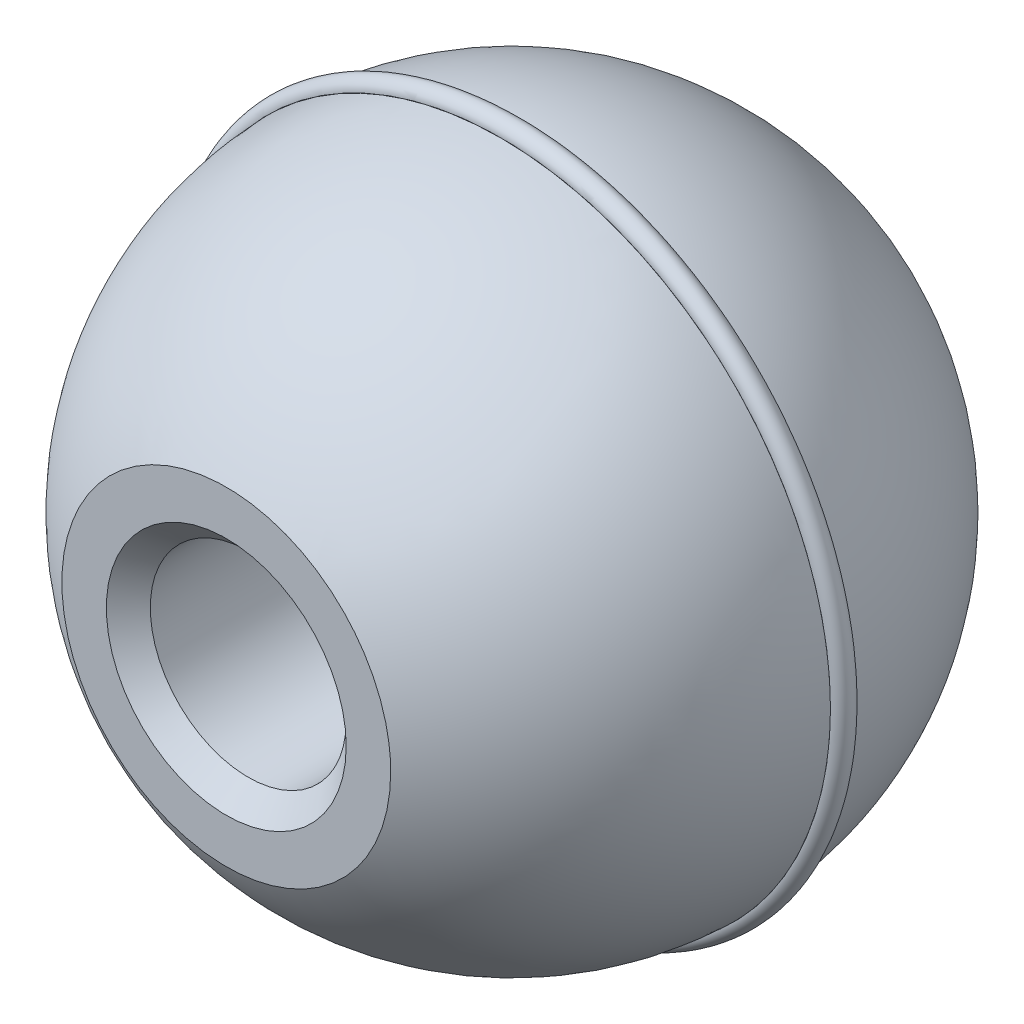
ISO-10303-21;
HEADER;
FILE_DESCRIPTION(('STEP AP214'),'2;1');
FILE_NAME('part.step','',(''),(''),'','','');
FILE_SCHEMA(('AUTOMOTIVE_DESIGN { 1 0 10303 214 1 1 1 1 }'));
ENDSEC;
DATA;
#1=APPLICATION_CONTEXT('core data for automotive mechanical design processes');
#2=APPLICATION_PROTOCOL_DEFINITION('international standard','automotive_design',2000,#1);
#3=PRODUCT_CONTEXT('',#1,'mechanical');
#4=PRODUCT('Part','Part','',(#3));
#5=PRODUCT_RELATED_PRODUCT_CATEGORY('part','',(#4));
#6=PRODUCT_DEFINITION_FORMATION('','',#4);
#7=PRODUCT_DEFINITION_CONTEXT('part definition',#1,'design');
#8=PRODUCT_DEFINITION('design','',#6,#7);
#9=PRODUCT_DEFINITION_SHAPE('','',#8);
#10=(LENGTH_UNIT() NAMED_UNIT(*) SI_UNIT(.MILLI.,.METRE.));
#11=(NAMED_UNIT(*) PLANE_ANGLE_UNIT() SI_UNIT($,.RADIAN.));
#12=(NAMED_UNIT(*) SI_UNIT($,.STERADIAN.) SOLID_ANGLE_UNIT());
#13=UNCERTAINTY_MEASURE_WITH_UNIT(LENGTH_MEASURE(1.E-05),#10,'distance_accuracy_value','');
#14=(GEOMETRIC_REPRESENTATION_CONTEXT(3) GLOBAL_UNCERTAINTY_ASSIGNED_CONTEXT((#13)) GLOBAL_UNIT_ASSIGNED_CONTEXT((#10,
#11,#12)) REPRESENTATION_CONTEXT('',''));
#15=CARTESIAN_POINT('',(0.,0.,0.));
#16=DIRECTION('',(0.,0.,1.));
#17=DIRECTION('',(1.,0.,0.));
#18=AXIS2_PLACEMENT_3D('',#15,#16,#17);
#19=CARTESIAN_POINT('',(0.,0.,13.));
#20=DIRECTION('',(0.,0.,1.));
#21=DIRECTION('',(1.,0.,0.));
#22=AXIS2_PLACEMENT_3D('',#19,#20,#21);
#23=PLANE('',#22);
#24=CARTESIAN_POINT('',(0.,0.,13.));
#25=DIRECTION('',(0.,0.,1.));
#26=DIRECTION('',(1.,0.,0.));
#27=AXIS2_PLACEMENT_3D('',#24,#25,#26);
#28=CIRCLE('',#27,5.45850000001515);
#29=CARTESIAN_POINT('',(5.45850000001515,0.,13.));
#30=VERTEX_POINT('',#29);
#31=EDGE_CURVE('E57',#30,#30,#28,.F.);
#32=ORIENTED_EDGE('',*,*,#31,.T.);
#33=EDGE_LOOP('',(#32));
#34=FACE_BOUND('',#33,.T.);
#35=CARTESIAN_POINT('',(7.48331477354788,0.,13.));
#36=CARTESIAN_POINT('',(7.48331628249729,-0.210246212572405,13.));
#37=CARTESIAN_POINT('',(7.47445072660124,-0.420467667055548,13.));
#38=CARTESIAN_POINT('',(7.43905038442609,-0.839486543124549,13.));
#39=CARTESIAN_POINT('',(7.41251094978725,-1.0482835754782,13.));
#40=CARTESIAN_POINT('',(7.34191342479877,-1.46308286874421,13.));
#41=CARTESIAN_POINT('',(7.2978397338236,-1.66908247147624,13.));
#42=CARTESIAN_POINT('',(7.19246872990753,-2.07670991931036,13.));
#43=CARTESIAN_POINT('',(7.13116512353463,-2.27833613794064,13.));
#44=CARTESIAN_POINT('',(6.99182402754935,-2.67556913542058,13.));
#45=CARTESIAN_POINT('',(6.91379774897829,-2.87117984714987,13.));
#46=CARTESIAN_POINT('',(6.74154067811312,-3.25513490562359,13.));
#47=CARTESIAN_POINT('',(6.6473096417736,-3.44347914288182,13.));
#48=CARTESIAN_POINT('',(6.4433413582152,-3.81150923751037,13.));
#49=CARTESIAN_POINT('',(6.33360827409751,-3.99119740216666,13.));
#50=CARTESIAN_POINT('',(6.09939404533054,-4.34069633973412,13.));
#51=CARTESIAN_POINT('',(5.97491255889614,-4.51050688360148,13.));
#52=CARTESIAN_POINT('',(5.71209889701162,-4.83902589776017,13.));
#53=CARTESIAN_POINT('',(5.57376782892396,-4.99773525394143,13.));
#54=CARTESIAN_POINT('',(5.2841795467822,-5.30299184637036,13.));
#55=CARTESIAN_POINT('',(5.13291787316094,-5.4495348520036,13.));
#56=CARTESIAN_POINT('',(4.81863549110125,-5.72931060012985,13.));
#57=CARTESIAN_POINT('',(4.65561854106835,-5.86254756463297,13.));
#58=CARTESIAN_POINT('',(4.31887933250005,-6.11486400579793,13.));
#59=CARTESIAN_POINT('',(4.14515314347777,-6.23393823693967,13.));
#60=CARTESIAN_POINT('',(3.7883231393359,-6.45700160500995,13.));
#61=CARTESIAN_POINT('',(3.6052213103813,-6.56099391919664,13.));
#62=CARTESIAN_POINT('',(3.23090509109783,-6.75318558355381,13.));
#63=CARTESIAN_POINT('',(3.0396905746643,-6.84138468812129,13.));
#64=CARTESIAN_POINT('',(2.6505153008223,-7.0013591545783,13.));
#65=CARTESIAN_POINT('',(2.45255468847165,-7.07313486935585,13.));
#66=CARTESIAN_POINT('',(2.05128594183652,-7.19975620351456,13.));
#67=CARTESIAN_POINT('',(1.84797768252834,-7.254601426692,13.));
#68=CARTESIAN_POINT('',(1.43750114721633,-7.34696112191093,13.));
#69=CARTESIAN_POINT('',(1.23033358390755,-7.38447876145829,13.));
#70=CARTESIAN_POINT('',(0.813502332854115,-7.44194139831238,13.));
#71=CARTESIAN_POINT('',(0.603837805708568,-7.46188030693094,13.));
#72=CARTESIAN_POINT('',(0.183649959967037,-7.484017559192,13.));
#73=CARTESIAN_POINT('',(-0.0268730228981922,-7.48622227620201,13.));
#74=CARTESIAN_POINT('',(-0.44743435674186,-7.47288974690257,13.));
#75=CARTESIAN_POINT('',(-0.657472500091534,-7.45734594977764,13.));
#76=CARTESIAN_POINT('',(-1.07545201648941,-7.40862097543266,13.));
#77=CARTESIAN_POINT('',(-1.2833937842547,-7.37544318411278,13.));
#78=CARTESIAN_POINT('',(-1.69574644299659,-7.29168753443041,13.));
#79=CARTESIAN_POINT('',(-1.9001572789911,-7.24110940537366,13.));
#80=CARTESIAN_POINT('',(-2.30398773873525,-7.1229138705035,13.));
#81=CARTESIAN_POINT('',(-2.50340745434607,-7.0552967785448,13.));
#82=CARTESIAN_POINT('',(-2.89584648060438,-6.90350177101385,13.));
#83=CARTESIAN_POINT('',(-3.08886564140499,-6.8193234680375,13.));
#84=CARTESIAN_POINT('',(-3.46709129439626,-6.63502262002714,13.));
#85=CARTESIAN_POINT('',(-3.65229922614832,-6.53490302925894,13.));
#86=CARTESIAN_POINT('',(-4.01368674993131,-6.31938259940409,13.));
#87=CARTESIAN_POINT('',(-4.18986319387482,-6.20397648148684,13.));
#88=CARTESIAN_POINT('',(-4.53180453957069,-5.95877452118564,13.));
#89=CARTESIAN_POINT('',(-4.69757314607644,-5.82898384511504,13.));
#90=CARTESIAN_POINT('',(-5.01764862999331,-5.55585106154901,13.));
#91=CARTESIAN_POINT('',(-5.17195125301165,-5.41250396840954,13.));
#92=CARTESIAN_POINT('',(-5.4679012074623,-5.11334704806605,13.));
#93=CARTESIAN_POINT('',(-5.6095509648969,-4.95753962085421,13.));
#94=CARTESIAN_POINT('',(-5.8792235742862,-4.63454355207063,13.));
#95=CARTESIAN_POINT('',(-6.0072462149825,-4.46735473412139,13.));
#96=CARTESIAN_POINT('',(-6.24874967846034,-4.12278872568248,13.));
#97=CARTESIAN_POINT('',(-6.36223078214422,-3.94541173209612,13.));
#98=CARTESIAN_POINT('',(-6.57384928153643,-3.58172800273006,13.));
#99=CARTESIAN_POINT('',(-6.67198631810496,-3.39542105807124,13.));
#100=CARTESIAN_POINT('',(-6.85220079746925,-3.01522343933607,13.));
#101=CARTESIAN_POINT('',(-6.93428124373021,-2.8213341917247,13.));
#102=CARTESIAN_POINT('',(-7.0818408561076,-2.42731528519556,13.));
#103=CARTESIAN_POINT('',(-7.14731418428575,-2.22718345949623,13.));
#104=CARTESIAN_POINT('',(-7.31799635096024,-1.61971357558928,13.));
#105=CARTESIAN_POINT('',(-7.39766124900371,-1.20489102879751,13.));
#106=CARTESIAN_POINT('',(-7.48611442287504,-0.367756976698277,13.));
#107=CARTESIAN_POINT('',(-7.49490269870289,0.0545545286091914,13.));
#108=CARTESIAN_POINT('',(-7.45494505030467,0.684281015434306,13.));
#109=CARTESIAN_POINT('',(-7.43274318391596,0.893676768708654,13.));
#110=CARTESIAN_POINT('',(-7.37078825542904,1.30983337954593,13.));
#111=CARTESIAN_POINT('',(-7.33104135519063,1.51659513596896,13.));
#112=CARTESIAN_POINT('',(-7.23426413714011,1.92606022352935,13.));
#113=CARTESIAN_POINT('',(-7.17723058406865,2.12876278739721,13.));
#114=CARTESIAN_POINT('',(-7.04629157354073,2.52864179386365,13.));
#115=CARTESIAN_POINT('',(-6.97238651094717,2.72581836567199,13.));
#116=CARTESIAN_POINT('',(-6.8082270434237,3.11324748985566,13.));
#117=CARTESIAN_POINT('',(-6.7179723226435,3.30349990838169,13.));
#118=CARTESIAN_POINT('',(-6.521757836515,3.67572249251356,13.));
#119=CARTESIAN_POINT('',(-6.41579831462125,3.85769278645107,13.));
#120=CARTESIAN_POINT('',(-6.18890459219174,4.21209436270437,13.));
#121=CARTESIAN_POINT('',(-6.06796751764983,4.38452380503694,13.));
#122=CARTESIAN_POINT('',(-5.81204221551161,4.71851792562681,13.));
#123=CARTESIAN_POINT('',(-5.67705919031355,4.88008659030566,13.));
#124=CARTESIAN_POINT('',(-5.39391359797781,5.1913364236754,13.));
#125=CARTESIAN_POINT('',(-5.24574632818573,5.34101331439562,13.));
#126=CARTESIAN_POINT('',(-4.93738081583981,5.62730112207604,13.));
#127=CARTESIAN_POINT('',(-4.77718675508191,5.76391654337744,13.));
#128=CARTESIAN_POINT('',(-4.44583034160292,6.02319318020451,13.));
#129=CARTESIAN_POINT('',(-4.27466596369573,6.14585180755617,13.));
#130=CARTESIAN_POINT('',(-3.92261662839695,6.37631086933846,13.));
#131=CARTESIAN_POINT('',(-3.74173189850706,6.48411165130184,13.));
#132=CARTESIAN_POINT('',(-3.37152070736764,6.68409389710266,13.));
#133=CARTESIAN_POINT('',(-3.18219409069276,6.77627507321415,13.));
#134=CARTESIAN_POINT('',(-2.79645128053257,6.94435900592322,13.));
#135=CARTESIAN_POINT('',(-2.60003519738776,7.02026201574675,13.));
#136=CARTESIAN_POINT('',(-2.20146870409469,7.15526479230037,13.));
#137=CARTESIAN_POINT('',(-1.99931720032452,7.21436133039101,13.));
#138=CARTESIAN_POINT('',(-1.590829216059,7.31529278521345,13.));
#139=CARTESIAN_POINT('',(-1.38449430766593,7.35713406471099,13.));
#140=CARTESIAN_POINT('',(-0.968958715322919,7.42330093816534,13.));
#141=CARTESIAN_POINT('',(-0.759757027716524,7.44762022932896,13.));
#142=CARTESIAN_POINT('',(-0.340121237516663,7.47854028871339,13.));
#143=CARTESIAN_POINT('',(-0.129687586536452,7.48514718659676,13.));
#144=CARTESIAN_POINT('',(0.291026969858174,7.4806127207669,13.));
#145=CARTESIAN_POINT('',(0.501307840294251,7.46946811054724,13.));
#146=CARTESIAN_POINT('',(0.920178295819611,7.42950424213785,13.));
#147=CARTESIAN_POINT('',(1.12876792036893,7.40068539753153,13.));
#148=CARTESIAN_POINT('',(1.54278244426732,7.32557749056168,13.));
#149=CARTESIAN_POINT('',(1.74820727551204,7.27928805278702,13.));
#150=CARTESIAN_POINT('',(2.15442395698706,7.16956897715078,13.));
#151=CARTESIAN_POINT('',(2.35521587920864,7.10613960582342,13.));
#152=CARTESIAN_POINT('',(2.75078437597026,6.96257609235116,13.));
#153=CARTESIAN_POINT('',(2.94555967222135,6.88243842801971,13.));
#154=CARTESIAN_POINT('',(3.32759464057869,6.70606903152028,13.));
#155=CARTESIAN_POINT('',(3.5148570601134,6.60984325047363,13.));
#156=CARTESIAN_POINT('',(3.88066983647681,6.40192764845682,13.));
#157=CARTESIAN_POINT('',(4.05921740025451,6.29023291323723,13.));
#158=CARTESIAN_POINT('',(4.40620663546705,6.05223831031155,13.));
#159=CARTESIAN_POINT('',(4.57465178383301,5.9259435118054,13.));
#160=CARTESIAN_POINT('',(4.90031927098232,5.65960453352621,13.));
#161=CARTESIAN_POINT('',(5.05754071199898,5.51955925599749,13.));
#162=CARTESIAN_POINT('',(5.35962491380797,5.22672662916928,13.));
#163=CARTESIAN_POINT('',(5.50448796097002,5.0739395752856,13.));
#164=CARTESIAN_POINT('',(5.78086695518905,4.7566638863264,13.));
#165=CARTESIAN_POINT('',(5.91237931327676,4.5921721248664,13.));
#166=CARTESIAN_POINT('',(6.16107551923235,4.25269578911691,13.));
#167=CARTESIAN_POINT('',(6.27825958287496,4.07771137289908,13.));
#168=CARTESIAN_POINT('',(6.49754163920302,3.71837117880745,13.));
#169=CARTESIAN_POINT('',(6.59962949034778,3.53400921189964,13.));
#170=CARTESIAN_POINT('',(6.78786393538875,3.15740467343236,13.));
#171=CARTESIAN_POINT('',(6.87401634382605,2.96516500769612,13.));
#172=CARTESIAN_POINT('',(7.02974403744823,2.5742796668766,13.));
#173=CARTESIAN_POINT('',(7.09933402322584,2.37563985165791,13.));
#174=CARTESIAN_POINT('',(7.22152362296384,1.97327222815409,13.));
#175=CARTESIAN_POINT('',(7.27412770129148,1.7695457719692,13.));
#176=CARTESIAN_POINT('',(7.37293786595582,1.30717268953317,13.));
#177=CARTESIAN_POINT('',(7.41429408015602,1.04747542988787,13.));
#178=CARTESIAN_POINT('',(7.46948159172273,0.525172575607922,13.));
#179=CARTESIAN_POINT('',(7.48331288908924,0.262566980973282,13.));
#180=CARTESIAN_POINT('',(7.48331477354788,0.,13.));
#181=B_SPLINE_CURVE_WITH_KNOTS('',3,(#35,#36,#37,#38,#39,#40,#41,#42,#43,#44,#45,#46,#47,#48,
#49,#50,#51,#52,#53,#54,#55,#56,#57,#58,#59,#60,#61,#62,#63,#64,#65,#66,#67,#68,#69,#70,#71,#72,
#73,#74,#75,#76,#77,#78,#79,#80,#81,#82,#83,#84,#85,#86,#87,#88,#89,#90,#91,#92,#93,#94,#95,#96,
#97,#98,#99,#100,#101,#102,#103,#104,#105,#106,#107,#108,#109,#110,#111,#112,#113,#114,#115,
#116,#117,#118,#119,#120,#121,#122,#123,#124,#125,#126,#127,#128,#129,#130,#131,#132,#133,#134,
#135,#136,#137,#138,#139,#140,#141,#142,#143,#144,#145,#146,#147,#148,#149,#150,#151,#152,#153,
#154,#155,#156,#157,#158,#159,#160,#161,#162,#163,#164,#165,#166,#167,#168,#169,#170,#171,#172,
#173,#174,#175,#176,#177,#178,#179,#180),.UNSPECIFIED.,.T.,.F.,(4,2,2,2,2,2,2,2,2,2,2,2,2,2,2,2,
2,2,2,2,2,2,2,2,2,2,2,2,2,2,2,2,2,2,2,2,2,2,2,2,2,2,2,2,2,2,2,2,2,2,2,2,2,2,2,2,2,2,2,2,2,2,2,2,
2,2,2,2,2,2,2,2,4),(0.,0.63050929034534,1.26118447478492,1.8924220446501,2.5238904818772,
3.15493689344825,3.78599280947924,4.41687957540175,5.04778096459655,5.67863194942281,
6.309701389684,6.94056995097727,7.57167144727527,8.20263979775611,8.83361795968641,
9.4645825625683,10.0955619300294,10.7264259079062,11.3575083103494,11.9883639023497,
12.619452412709,13.2504197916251,13.881396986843,14.5123625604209,15.1433428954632,
15.7742064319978,16.4052883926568,17.0361444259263,17.6672333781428,18.2982010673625,
18.9291785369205,19.560143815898,20.191123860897,20.8219857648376,21.4530691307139,
22.7138923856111,23.9747156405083,24.6057990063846,25.2366609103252,25.8676409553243,
26.4986062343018,27.1295837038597,27.7605513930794,28.3916403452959,29.0224963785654,
29.6535783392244,30.284441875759,30.9154222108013,31.5463877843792,32.1773649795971,
32.8083323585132,33.4394208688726,34.0702764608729,34.701358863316,35.3322228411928,
35.9632022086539,36.5941668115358,37.2251449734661,37.856113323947,38.487214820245,
39.1180833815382,39.7491528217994,40.3800038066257,41.0109051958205,41.641791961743,
42.272847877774,42.903894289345,43.5353627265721,44.1666002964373,44.7972754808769,
45.4277847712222,46.2151992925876,47.002613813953),.UNSPECIFIED.);
#182=CARTESIAN_POINT('',(7.48331477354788,0.,13.));
#183=VERTEX_POINT('',#182);
#184=EDGE_CURVE('E71',#183,#183,#181,.T.);
#185=ORIENTED_EDGE('',*,*,#184,.F.);
#186=EDGE_LOOP('',(#185));
#187=FACE_BOUND('',#186,.T.);
#188=ADVANCED_FACE('F50',(#34,#187),#23,.T.);
#189=CARTESIAN_POINT('',(0.,0.,0.));
#190=DIRECTION('',(1.,0.,0.));
#191=DIRECTION('',(0.,1.,0.));
#192=AXIS2_PLACEMENT_3D('',#189,#190,#191);
#193=SPHERICAL_SURFACE('',#192,15.);
#194=ORIENTED_EDGE('',*,*,#184,.T.);
#195=EDGE_LOOP('',(#194));
#196=FACE_BOUND('',#195,.T.);
#197=CARTESIAN_POINT('',(14.9916643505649,0.,0.5));
#198=CARTESIAN_POINT('',(14.9916644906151,-0.333641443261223,0.5));
#199=CARTESIAN_POINT('',(14.9805224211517,-0.66728470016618,0.5));
#200=CARTESIAN_POINT('',(14.9357697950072,-1.33657962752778,0.5));
#201=CARTESIAN_POINT('',(14.9019246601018,-1.67221562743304,0.5));
#202=CARTESIAN_POINT('',(14.8116749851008,-2.34051363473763,0.5));
#203=CARTESIAN_POINT('',(14.7552655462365,-2.67317498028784,0.5));
#204=CARTESIAN_POINT('',(14.6200308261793,-3.33448374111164,0.5));
#205=CARTESIAN_POINT('',(14.541168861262,-3.66312366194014,0.5));
#206=CARTESIAN_POINT('',(14.3614275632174,-4.31433958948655,0.5));
#207=CARTESIAN_POINT('',(14.2605464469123,-4.63691510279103,0.499999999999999));
#208=CARTESIAN_POINT('',(14.0095797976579,-5.35342629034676,0.499999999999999));
#209=CARTESIAN_POINT('',(13.8534956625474,-5.74527713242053,0.5));
#210=CARTESIAN_POINT('',(13.5088567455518,-6.51448105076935,0.5));
#211=CARTESIAN_POINT('',(13.3202966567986,-6.89183174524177,0.5));
#212=CARTESIAN_POINT('',(12.9120308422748,-7.62935945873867,0.5));
#213=CARTESIAN_POINT('',(12.6923212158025,-7.98953431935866,0.5));
#214=CARTESIAN_POINT('',(12.2233416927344,-8.69008623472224,0.5));
#215=CARTESIAN_POINT('',(11.974072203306,-9.03046356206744,0.500000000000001));
#216=CARTESIAN_POINT('',(11.447762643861,-9.68898227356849,0.500000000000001));
#217=CARTESIAN_POINT('',(11.1707246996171,-10.007125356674,0.5));
#218=CARTESIAN_POINT('',(10.5908292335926,-10.6189448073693,0.5));
#219=CARTESIAN_POINT('',(10.2879714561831,-10.9126209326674,0.5));
#220=CARTESIAN_POINT('',(9.65860675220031,-11.4734018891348,0.5));
#221=CARTESIAN_POINT('',(9.33210094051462,-11.7405079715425,0.5));
#222=CARTESIAN_POINT('',(8.65774952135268,-12.246265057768,0.5));
#223=CARTESIAN_POINT('',(8.30990396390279,-12.4849161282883,0.500000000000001));
#224=CARTESIAN_POINT('',(7.59533830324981,-12.9320716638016,0.500000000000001));
#225=CARTESIAN_POINT('',(7.22861783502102,-13.1405755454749,0.5));
#226=CARTESIAN_POINT('',(6.47891548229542,-13.5259489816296,0.5));
#227=CARTESIAN_POINT('',(6.0959335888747,-13.7028185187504,0.5));
#228=CARTESIAN_POINT('',(5.31642890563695,-14.0236666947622,0.5));
#229=CARTESIAN_POINT('',(4.91990603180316,-14.1676451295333,0.5));
#230=CARTESIAN_POINT('',(4.11614073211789,-14.4216860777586,0.5));
#231=CARTESIAN_POINT('',(3.7088983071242,-14.5317485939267,0.499999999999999));
#232=CARTESIAN_POINT('',(2.8865904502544,-14.7171749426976,0.499999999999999));
#233=CARTESIAN_POINT('',(2.47152504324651,-14.7925388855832,0.5));
#234=CARTESIAN_POINT('',(1.63652097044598,-14.9080327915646,0.5));
#235=CARTESIAN_POINT('',(1.21658230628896,-14.9481627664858,0.5));
#236=CARTESIAN_POINT('',(0.374817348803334,-14.9929034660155,0.5));
#237=CARTESIAN_POINT('',(-0.0470089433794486,-14.9975142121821,0.500000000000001));
#238=CARTESIAN_POINT('',(-0.889551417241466,-14.971183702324,0.499999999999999));
#239=CARTESIAN_POINT('',(-1.31026759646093,-14.9402423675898,0.499999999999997));
#240=CARTESIAN_POINT('',(-2.14759734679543,-14.8430276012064,0.499999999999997));
#241=CARTESIAN_POINT('',(-2.56421092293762,-14.7767542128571,0.499999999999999));
#242=CARTESIAN_POINT('',(-3.39036938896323,-14.6093474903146,0.500000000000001));
#243=CARTESIAN_POINT('',(-3.79991435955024,-14.5082145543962,0.5));
#244=CARTESIAN_POINT('',(-4.60903565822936,-14.2718055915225,0.5));
#245=CARTESIAN_POINT('',(-5.00861182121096,-14.1365289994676,0.499999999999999));
#246=CARTESIAN_POINT('',(-5.7949480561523,-13.8327951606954,0.500000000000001));
#247=CARTESIAN_POINT('',(-6.18170811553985,-13.66433788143,0.500000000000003));
#248=CARTESIAN_POINT('',(-6.93972204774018,-13.2954111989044,0.500000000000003));
#249=CARTESIAN_POINT('',(-7.31097346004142,-13.0949367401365,0.500000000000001));
#250=CARTESIAN_POINT('',(-8.03518100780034,-12.6634704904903,0.499999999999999));
#251=CARTESIAN_POINT('',(-8.38814136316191,-12.4324857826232,0.5));
#252=CARTESIAN_POINT('',(-9.07319121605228,-11.941719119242,0.5));
#253=CARTESIAN_POINT('',(-9.40529031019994,-11.6819505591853,0.5));
#254=CARTESIAN_POINT('',(-10.0467473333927,-11.1351095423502,0.5));
#255=CARTESIAN_POINT('',(-10.356082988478,-10.8480109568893,0.500000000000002));
#256=CARTESIAN_POINT('',(-10.9492676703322,-10.2489564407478,0.500000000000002));
#257=CARTESIAN_POINT('',(-11.2331328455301,-9.93701649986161,0.5));
#258=CARTESIAN_POINT('',(-11.7737035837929,-9.29019020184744,0.5));
#259=CARTESIAN_POINT('',(-12.0303968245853,-8.95529354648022,0.5));
#260=CARTESIAN_POINT('',(-12.5146408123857,-8.26507600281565,0.5));
#261=CARTESIAN_POINT('',(-12.7421927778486,-7.90975596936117,0.5));
#262=CARTESIAN_POINT('',(-13.1664522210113,-7.18137103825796,0.5));
#263=CARTESIAN_POINT('',(-13.3631736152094,-6.80831424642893,0.499999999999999));
#264=CARTESIAN_POINT('',(-13.7248253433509,-6.04626910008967,0.499999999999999));
#265=CARTESIAN_POINT('',(-13.8896974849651,-5.65725312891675,0.5));
#266=CARTESIAN_POINT('',(-14.1859131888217,-4.86700862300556,0.5));
#267=CARTESIAN_POINT('',(-14.3172833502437,-4.46579006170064,0.5));
#268=CARTESIAN_POINT('',(-14.5455299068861,-3.65443230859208,0.5));
#269=CARTESIAN_POINT('',(-14.64246628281,-3.24430996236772,0.5));
#270=CARTESIAN_POINT('',(-14.8014541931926,-2.4174518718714,0.5));
#271=CARTESIAN_POINT('',(-14.8635179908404,-2.000718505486,0.5));
#272=CARTESIAN_POINT('',(-14.9297868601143,-1.37635647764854,0.5));
#273=CARTESIAN_POINT('',(-14.94736721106,-1.17006798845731,0.5));
#274=CARTESIAN_POINT('',(-14.973973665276,-0.756940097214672,0.5));
#275=CARTESIAN_POINT('',(-14.9829997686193,-0.55010069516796,0.499999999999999));
#276=CARTESIAN_POINT('',(-14.9973670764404,0.0776039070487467,0.499999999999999));
#277=CARTESIAN_POINT('',(-14.9892715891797,0.49885569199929,0.5));
#278=CARTESIAN_POINT('',(-14.9376605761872,1.33927684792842,0.5));
#279=CARTESIAN_POINT('',(-14.8941325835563,1.75844543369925,0.5));
#280=CARTESIAN_POINT('',(-14.7718468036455,2.5923783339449,0.5));
#281=CARTESIAN_POINT('',(-14.6930273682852,3.00713363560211,0.5));
#282=CARTESIAN_POINT('',(-14.5006256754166,3.82884633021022,0.5));
#283=CARTESIAN_POINT('',(-14.387015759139,4.23579724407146,0.5));
#284=CARTESIAN_POINT('',(-14.1261014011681,5.03793719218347,0.5));
#285=CARTESIAN_POINT('',(-13.9788582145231,5.43314615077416,0.5));
#286=CARTESIAN_POINT('',(-13.6515356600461,6.20993481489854,0.5));
#287=CARTESIAN_POINT('',(-13.4714414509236,6.59150826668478,0.5));
#288=CARTESIAN_POINT('',(-13.0797340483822,7.33813923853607,0.5));
#289=CARTESIAN_POINT('',(-12.868119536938,7.70319606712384,0.5));
#290=CARTESIAN_POINT('',(-12.4149847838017,8.41401944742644,0.5));
#291=CARTESIAN_POINT('',(-12.1734780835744,8.75979463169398,0.5));
#292=CARTESIAN_POINT('',(-11.662036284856,9.42998972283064,0.5));
#293=CARTESIAN_POINT('',(-11.3920831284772,9.75439584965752,0.5));
#294=CARTESIAN_POINT('',(-10.8260702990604,10.3790007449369,0.5));
#295=CARTESIAN_POINT('',(-10.5300360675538,10.6792225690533,0.5));
#296=CARTESIAN_POINT('',(-9.91359756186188,11.253808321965,0.5));
#297=CARTESIAN_POINT('',(-9.59318203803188,11.5281601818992,0.5));
#298=CARTESIAN_POINT('',(-8.93030247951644,12.0489584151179,0.5));
#299=CARTESIAN_POINT('',(-8.58783335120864,12.2953983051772,0.5));
#300=CARTESIAN_POINT('',(-7.88340443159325,12.7585100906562,0.5));
#301=CARTESIAN_POINT('',(-7.52144772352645,12.975186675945,0.5));
#302=CARTESIAN_POINT('',(-6.78056786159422,13.377277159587,0.5));
#303=CARTESIAN_POINT('',(-6.40164472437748,13.5626910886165,0.5));
#304=CARTESIAN_POINT('',(-5.62953247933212,13.9009353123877,0.5));
#305=CARTESIAN_POINT('',(-5.23634362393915,14.0537661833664,0.5));
#306=CARTESIAN_POINT('',(-4.43848431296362,14.3257634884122,0.5));
#307=CARTESIAN_POINT('',(-4.03381372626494,14.444929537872,0.5));
#308=CARTESIAN_POINT('',(-3.21587146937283,14.648747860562,0.5));
#309=CARTESIAN_POINT('',(-2.80259978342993,14.7334000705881,0.5));
#310=CARTESIAN_POINT('',(-1.97039508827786,14.867588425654,0.5));
#311=CARTESIAN_POINT('',(-1.55146209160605,14.9171246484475,0.5));
#312=CARTESIAN_POINT('',(-0.71091201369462,14.9807291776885,0.5));
#313=CARTESIAN_POINT('',(-0.289294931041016,14.9947974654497,0.5));
#314=CARTESIAN_POINT('',(0.553625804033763,14.9873660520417,0.5));
#315=CARTESIAN_POINT('',(0.974929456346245,14.9658663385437,0.5));
#316=CARTESIAN_POINT('',(1.81422590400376,14.8874519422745,0.5));
#317=CARTESIAN_POINT('',(2.23221871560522,14.8305374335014,0.5));
#318=CARTESIAN_POINT('',(3.06192392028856,14.6816982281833,0.5));
#319=CARTESIAN_POINT('',(3.47363631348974,14.5897735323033,0.5));
#320=CARTESIAN_POINT('',(4.28785774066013,14.3715663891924,0.5));
#321=CARTESIAN_POINT('',(4.69036668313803,14.2452836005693,0.5));
#322=CARTESIAN_POINT('',(5.48331532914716,13.9592584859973,0.5));
#323=CARTESIAN_POINT('',(5.87375503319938,13.7995161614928,0.5));
#324=CARTESIAN_POINT('',(6.63980100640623,13.4477023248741,0.5));
#325=CARTESIAN_POINT('',(7.01540682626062,13.2556298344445,0.5));
#326=CARTESIAN_POINT('',(7.7491021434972,12.8405245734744,0.5));
#327=CARTESIAN_POINT('',(8.10719163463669,12.6174917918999,0.5));
#328=CARTESIAN_POINT('',(8.80328376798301,12.1420684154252,0.5));
#329=CARTESIAN_POINT('',(9.14128781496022,11.8896798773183,0.5));
#330=CARTESIAN_POINT('',(9.79483285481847,11.3573271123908,0.5));
#331=CARTESIAN_POINT('',(10.1103738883,11.0773629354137,0.5));
#332=CARTESIAN_POINT('',(10.7167033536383,10.4918942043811,0.5));
#333=CARTESIAN_POINT('',(11.0074956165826,10.1863936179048,0.5));
#334=CARTESIAN_POINT('',(11.5623176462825,9.551983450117,0.5));
#335=CARTESIAN_POINT('',(11.8263472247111,9.22307370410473,0.5));
#336=CARTESIAN_POINT('',(12.3258617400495,8.54405330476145,0.5));
#337=CARTESIAN_POINT('',(12.5613356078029,8.19393450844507,0.5));
#338=CARTESIAN_POINT('',(13.0019389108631,7.47511127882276,0.5));
#339=CARTESIAN_POINT('',(13.2070692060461,7.10640737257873,0.5));
#340=CARTESIAN_POINT('',(13.5856599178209,6.35277782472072,0.5));
#341=CARTESIAN_POINT('',(13.7590992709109,5.96784160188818,0.5));
#342=CARTESIAN_POINT('',(14.0729048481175,5.18471625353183,0.5));
#343=CARTESIAN_POINT('',(14.213271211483,4.78652718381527,0.5));
#344=CARTESIAN_POINT('',(14.4597547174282,3.98031856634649,0.5));
#345=CARTESIAN_POINT('',(14.5659206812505,3.5723139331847,0.5));
#346=CARTESIAN_POINT('',(14.7434851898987,2.74897767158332,0.5));
#347=CARTESIAN_POINT('',(14.8148997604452,2.33364951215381,0.5));
#348=CARTESIAN_POINT('',(14.9096624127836,1.59833383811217,0.5));
#349=CARTESIAN_POINT('',(14.9404184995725,1.27927932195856,0.5));
#350=CARTESIAN_POINT('',(14.9814095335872,0.640149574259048,0.5));
#351=CARTESIAN_POINT('',(14.9916642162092,0.320075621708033,0.5));
#352=CARTESIAN_POINT('',(14.9916643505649,0.,0.5));
#353=B_SPLINE_CURVE_WITH_KNOTS('',3,(#197,#198,#199,#200,#201,#202,#203,#204,#205,#206,#207,
#208,#209,#210,#211,#212,#213,#214,#215,#216,#217,#218,#219,#220,#221,#222,#223,#224,#225,#226,
#227,#228,#229,#230,#231,#232,#233,#234,#235,#236,#237,#238,#239,#240,#241,#242,#243,#244,#245,
#246,#247,#248,#249,#250,#251,#252,#253,#254,#255,#256,#257,#258,#259,#260,#261,#262,#263,#264,
#265,#266,#267,#268,#269,#270,#271,#272,#273,#274,#275,#276,#277,#278,#279,#280,#281,#282,#283,
#284,#285,#286,#287,#288,#289,#290,#291,#292,#293,#294,#295,#296,#297,#298,#299,#300,#301,#302,
#303,#304,#305,#306,#307,#308,#309,#310,#311,#312,#313,#314,#315,#316,#317,#318,#319,#320,#321,
#322,#323,#324,#325,#326,#327,#328,#329,#330,#331,#332,#333,#334,#335,#336,#337,#338,#339,#340,
#341,#342,#343,#344,#345,#346,#347,#348,#349,#350,#351,#352),.UNSPECIFIED.,.T.,.F.,(4,2,2,2,2,2,
2,2,2,2,2,2,2,2,2,2,2,2,2,2,2,2,2,2,2,2,2,2,2,2,2,2,2,2,2,2,2,2,2,2,2,2,2,2,2,2,2,2,2,2,2,2,2,2,
2,2,2,2,2,2,2,2,2,2,2,2,2,2,2,2,2,2,2,2,2,2,2,4),(0.,1.00074284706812,2.01198843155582,
3.02345367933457,4.03658107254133,5.04979054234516,6.31361675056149,7.57764967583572,
8.84184102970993,10.1060149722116,11.3700922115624,12.6341819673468,13.8982121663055,
15.1622394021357,16.4262910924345,17.6903434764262,18.9544037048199,20.218463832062,
21.4825199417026,22.7465756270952,24.0106305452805,25.2746882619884,26.5387444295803,
27.8027861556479,29.0668488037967,30.3309126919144,31.5951763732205,32.8591470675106,
34.1225319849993,35.3871371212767,36.6509347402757,37.9153030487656,39.1796184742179,
40.4433615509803,41.7093922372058,42.9744145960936,44.237222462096,45.499585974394,
46.1205422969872,46.7414986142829,48.0038620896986,49.2666699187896,50.5316923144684,
51.7977230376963,53.0614661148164,54.3257815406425,55.5901498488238,56.8539474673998,
58.1185522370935,59.3819367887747,60.6459078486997,61.910171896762,63.1742365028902,
64.4382998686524,65.7023408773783,66.966396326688,68.2304540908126,69.4945090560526,
70.7585646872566,72.0226207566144,73.286670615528,74.5507204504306,75.8147828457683,
77.0788451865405,78.3429457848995,79.6070468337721,80.8710593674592,82.1350696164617,
83.3988838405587,84.6627069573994,85.9270184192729,87.191294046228,88.4564069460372,
89.7215145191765,90.9848080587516,92.2475184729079,93.2084967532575,94.1685495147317),.UNSPECIFIED.);
#354=CARTESIAN_POINT('',(14.9916643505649,0.,0.5));
#355=VERTEX_POINT('',#354);
#356=EDGE_CURVE('E80',#355,#355,#353,.T.);
#357=ORIENTED_EDGE('',*,*,#356,.F.);
#358=EDGE_LOOP('',(#357));
#359=FACE_BOUND('',#358,.T.);
#360=ADVANCED_FACE('F88',(#196,#359),#193,.T.);
#361=CARTESIAN_POINT('',(0.,0.,0.5));
#362=DIRECTION('',(0.,0.,1.));
#363=DIRECTION('',(1.,0.,0.));
#364=AXIS2_PLACEMENT_3D('',#361,#362,#363);
#365=PLANE('',#364);
#366=ORIENTED_EDGE('',*,*,#356,.T.);
#367=EDGE_LOOP('',(#366));
#368=FACE_BOUND('',#367,.T.);
#369=CARTESIAN_POINT('',(0.,0.,0.5));
#370=DIRECTION('',(0.,0.,-1.));
#371=DIRECTION('',(1.,0.,0.));
#372=AXIS2_PLACEMENT_3D('',#369,#370,#371);
#373=CIRCLE('',#372,15.);
#374=CARTESIAN_POINT('',(15.,0.,0.5));
#375=VERTEX_POINT('',#374);
#376=EDGE_CURVE('E181',#375,#375,#373,.T.);
#377=ORIENTED_EDGE('',*,*,#376,.F.);
#378=EDGE_LOOP('',(#377));
#379=FACE_BOUND('',#378,.T.);
#380=ADVANCED_FACE('F144',(#368,#379),#365,.T.);
#381=CARTESIAN_POINT('',(0.,0.,0.));
#382=DIRECTION('',(0.,0.,1.));
#383=DIRECTION('',(1.,0.,0.));
#384=AXIS2_PLACEMENT_3D('',#381,#382,#383);
#385=TOROIDAL_SURFACE('',#384,15.,0.5);
#386=CARTESIAN_POINT('',(0.,0.,-0.5));
#387=DIRECTION('',(0.,0.,1.));
#388=DIRECTION('',(1.,0.,0.));
#389=AXIS2_PLACEMENT_3D('',#386,#387,#388);
#390=CIRCLE('',#389,15.);
#391=CARTESIAN_POINT('',(15.,0.,-0.5));
#392=VERTEX_POINT('',#391);
#393=EDGE_CURVE('E130',#392,#392,#390,.T.);
#394=ORIENTED_EDGE('',*,*,#393,.T.);
#395=EDGE_LOOP('',(#394));
#396=FACE_BOUND('',#395,.T.);
#397=ORIENTED_EDGE('',*,*,#376,.T.);
#398=EDGE_LOOP('',(#397));
#399=FACE_BOUND('',#398,.T.);
#400=ADVANCED_FACE('F116',(#396,#399),#385,.T.);
#401=CARTESIAN_POINT('',(0.,0.,-0.5));
#402=DIRECTION('',(0.,0.,1.));
#403=DIRECTION('',(1.,0.,0.));
#404=AXIS2_PLACEMENT_3D('',#401,#402,#403);
#405=PLANE('',#404);
#406=CARTESIAN_POINT('',(14.9916643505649,0.,-0.5));
#407=CARTESIAN_POINT('',(14.9916644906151,-0.333641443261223,-0.5));
#408=CARTESIAN_POINT('',(14.9805224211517,-0.66728470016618,-0.5));
#409=CARTESIAN_POINT('',(14.9357697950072,-1.33657962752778,-0.5));
#410=CARTESIAN_POINT('',(14.9019246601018,-1.67221562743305,-0.5));
#411=CARTESIAN_POINT('',(14.8116749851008,-2.34051363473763,-0.5));
#412=CARTESIAN_POINT('',(14.7552655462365,-2.67317498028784,-0.5));
#413=CARTESIAN_POINT('',(14.6200308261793,-3.33448374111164,-0.5));
#414=CARTESIAN_POINT('',(14.541168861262,-3.66312366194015,-0.5));
#415=CARTESIAN_POINT('',(14.3614275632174,-4.31433958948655,-0.5));
#416=CARTESIAN_POINT('',(14.2605464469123,-4.63691510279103,-0.5));
#417=CARTESIAN_POINT('',(14.0095797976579,-5.35342629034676,-0.5));
#418=CARTESIAN_POINT('',(13.8534956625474,-5.74527713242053,-0.5));
#419=CARTESIAN_POINT('',(13.5088567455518,-6.51448105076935,-0.5));
#420=CARTESIAN_POINT('',(13.3202966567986,-6.89183174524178,-0.5));
#421=CARTESIAN_POINT('',(12.9120308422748,-7.62935945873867,-0.5));
#422=CARTESIAN_POINT('',(12.6923212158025,-7.98953431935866,-0.5));
#423=CARTESIAN_POINT('',(12.2233416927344,-8.69008623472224,-0.5));
#424=CARTESIAN_POINT('',(11.974072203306,-9.03046356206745,-0.499999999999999));
#425=CARTESIAN_POINT('',(11.447762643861,-9.6889822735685,-0.499999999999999));
#426=CARTESIAN_POINT('',(11.1707246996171,-10.007125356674,-0.5));
#427=CARTESIAN_POINT('',(10.5908292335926,-10.6189448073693,-0.5));
#428=CARTESIAN_POINT('',(10.2879714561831,-10.9126209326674,-0.5));
#429=CARTESIAN_POINT('',(9.65860675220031,-11.4734018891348,-0.5));
#430=CARTESIAN_POINT('',(9.33210094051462,-11.7405079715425,-0.5));
#431=CARTESIAN_POINT('',(8.65774952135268,-12.246265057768,-0.5));
#432=CARTESIAN_POINT('',(8.30990396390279,-12.4849161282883,-0.499999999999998));
#433=CARTESIAN_POINT('',(7.59533830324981,-12.9320716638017,-0.499999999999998));
#434=CARTESIAN_POINT('',(7.22861783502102,-13.1405755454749,-0.499999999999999));
#435=CARTESIAN_POINT('',(6.47891548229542,-13.5259489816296,-0.500000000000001));
#436=CARTESIAN_POINT('',(6.0959335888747,-13.7028185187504,-0.5));
#437=CARTESIAN_POINT('',(5.31642890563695,-14.0236666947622,-0.5));
#438=CARTESIAN_POINT('',(4.91990603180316,-14.1676451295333,-0.5));
#439=CARTESIAN_POINT('',(4.11614073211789,-14.4216860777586,-0.5));
#440=CARTESIAN_POINT('',(3.7088983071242,-14.5317485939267,-0.500000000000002));
#441=CARTESIAN_POINT('',(2.8865904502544,-14.7171749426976,-0.500000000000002));
#442=CARTESIAN_POINT('',(2.47152504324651,-14.7925388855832,-0.5));
#443=CARTESIAN_POINT('',(1.63652097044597,-14.9080327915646,-0.5));
#444=CARTESIAN_POINT('',(1.21658230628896,-14.9481627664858,-0.5));
#445=CARTESIAN_POINT('',(0.374817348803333,-14.9929034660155,-0.5));
#446=CARTESIAN_POINT('',(-0.0470089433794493,-14.9975142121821,-0.5));
#447=CARTESIAN_POINT('',(-0.889551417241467,-14.971183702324,-0.5));
#448=CARTESIAN_POINT('',(-1.31026759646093,-14.9402423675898,-0.5));
#449=CARTESIAN_POINT('',(-2.14759734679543,-14.8430276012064,-0.5));
#450=CARTESIAN_POINT('',(-2.56421092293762,-14.7767542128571,-0.5));
#451=CARTESIAN_POINT('',(-3.39036938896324,-14.6093474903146,-0.5));
#452=CARTESIAN_POINT('',(-3.79991435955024,-14.5082145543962,-0.5));
#453=CARTESIAN_POINT('',(-4.60903565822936,-14.2718055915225,-0.5));
#454=CARTESIAN_POINT('',(-5.00861182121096,-14.1365289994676,-0.5));
#455=CARTESIAN_POINT('',(-5.7949480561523,-13.8327951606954,-0.5));
#456=CARTESIAN_POINT('',(-6.18170811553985,-13.66433788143,-0.499999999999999));
#457=CARTESIAN_POINT('',(-6.93972204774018,-13.2954111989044,-0.499999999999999));
#458=CARTESIAN_POINT('',(-7.31097346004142,-13.0949367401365,-0.5));
#459=CARTESIAN_POINT('',(-8.03518100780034,-12.6634704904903,-0.5));
#460=CARTESIAN_POINT('',(-8.38814136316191,-12.4324857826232,-0.5));
#461=CARTESIAN_POINT('',(-9.07319121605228,-11.941719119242,-0.5));
#462=CARTESIAN_POINT('',(-9.40529031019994,-11.6819505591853,-0.5));
#463=CARTESIAN_POINT('',(-10.0467473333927,-11.1351095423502,-0.5));
#464=CARTESIAN_POINT('',(-10.356082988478,-10.8480109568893,-0.499999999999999));
#465=CARTESIAN_POINT('',(-10.9492676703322,-10.2489564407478,-0.499999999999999));
#466=CARTESIAN_POINT('',(-11.2331328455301,-9.93701649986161,-0.5));
#467=CARTESIAN_POINT('',(-11.7737035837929,-9.29019020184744,-0.5));
#468=CARTESIAN_POINT('',(-12.0303968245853,-8.95529354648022,-0.5));
#469=CARTESIAN_POINT('',(-12.5146408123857,-8.26507600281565,-0.5));
#470=CARTESIAN_POINT('',(-12.7421927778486,-7.90975596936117,-0.5));
#471=CARTESIAN_POINT('',(-13.1664522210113,-7.18137103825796,-0.5));
#472=CARTESIAN_POINT('',(-13.3631736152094,-6.80831424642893,-0.5));
#473=CARTESIAN_POINT('',(-13.7248253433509,-6.04626910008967,-0.5));
#474=CARTESIAN_POINT('',(-13.8896974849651,-5.65725312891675,-0.5));
#475=CARTESIAN_POINT('',(-14.1859131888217,-4.86700862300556,-0.5));
#476=CARTESIAN_POINT('',(-14.3172833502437,-4.46579006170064,-0.5));
#477=CARTESIAN_POINT('',(-14.5455299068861,-3.65443230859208,-0.5));
#478=CARTESIAN_POINT('',(-14.64246628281,-3.24430996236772,-0.5));
#479=CARTESIAN_POINT('',(-14.8014541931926,-2.4174518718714,-0.5));
#480=CARTESIAN_POINT('',(-14.8635179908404,-2.000718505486,-0.5));
#481=CARTESIAN_POINT('',(-14.9297868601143,-1.37635647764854,-0.5));
#482=CARTESIAN_POINT('',(-14.94736721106,-1.17006798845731,-0.5));
#483=CARTESIAN_POINT('',(-14.973973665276,-0.756940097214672,-0.5));
#484=CARTESIAN_POINT('',(-14.9829997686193,-0.55010069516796,-0.499999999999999));
#485=CARTESIAN_POINT('',(-14.9973670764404,0.0776039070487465,-0.499999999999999));
#486=CARTESIAN_POINT('',(-14.9892715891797,0.49885569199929,-0.5));
#487=CARTESIAN_POINT('',(-14.9376605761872,1.33927684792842,-0.5));
#488=CARTESIAN_POINT('',(-14.8941325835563,1.75844543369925,-0.5));
#489=CARTESIAN_POINT('',(-14.7718468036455,2.5923783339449,-0.5));
#490=CARTESIAN_POINT('',(-14.6930273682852,3.00713363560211,-0.5));
#491=CARTESIAN_POINT('',(-14.5006256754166,3.82884633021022,-0.5));
#492=CARTESIAN_POINT('',(-14.387015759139,4.23579724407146,-0.5));
#493=CARTESIAN_POINT('',(-14.1261014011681,5.03793719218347,-0.5));
#494=CARTESIAN_POINT('',(-13.9788582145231,5.43314615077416,-0.5));
#495=CARTESIAN_POINT('',(-13.6515356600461,6.20993481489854,-0.5));
#496=CARTESIAN_POINT('',(-13.4714414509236,6.59150826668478,-0.5));
#497=CARTESIAN_POINT('',(-13.0797340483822,7.33813923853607,-0.5));
#498=CARTESIAN_POINT('',(-12.868119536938,7.70319606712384,-0.499999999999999));
#499=CARTESIAN_POINT('',(-12.4149847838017,8.41401944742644,-0.500000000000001));
#500=CARTESIAN_POINT('',(-12.1734780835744,8.75979463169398,-0.500000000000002));
#501=CARTESIAN_POINT('',(-11.662036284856,9.42998972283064,-0.500000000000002));
#502=CARTESIAN_POINT('',(-11.3920831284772,9.75439584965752,-0.500000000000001));
#503=CARTESIAN_POINT('',(-10.8260702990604,10.3790007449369,-0.499999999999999));
#504=CARTESIAN_POINT('',(-10.5300360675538,10.6792225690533,-0.5));
#505=CARTESIAN_POINT('',(-9.91359756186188,11.253808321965,-0.5));
#506=CARTESIAN_POINT('',(-9.59318203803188,11.5281601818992,-0.5));
#507=CARTESIAN_POINT('',(-8.93030247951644,12.0489584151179,-0.5));
#508=CARTESIAN_POINT('',(-8.58783335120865,12.2953983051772,-0.5));
#509=CARTESIAN_POINT('',(-7.88340443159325,12.7585100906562,-0.5));
#510=CARTESIAN_POINT('',(-7.52144772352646,12.975186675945,-0.5));
#511=CARTESIAN_POINT('',(-6.78056786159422,13.377277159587,-0.5));
#512=CARTESIAN_POINT('',(-6.40164472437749,13.5626910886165,-0.5));
#513=CARTESIAN_POINT('',(-5.62953247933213,13.9009353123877,-0.5));
#514=CARTESIAN_POINT('',(-5.23634362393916,14.0537661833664,-0.5));
#515=CARTESIAN_POINT('',(-4.43848431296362,14.3257634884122,-0.5));
#516=CARTESIAN_POINT('',(-4.03381372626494,14.444929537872,-0.5));
#517=CARTESIAN_POINT('',(-3.21587146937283,14.648747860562,-0.5));
#518=CARTESIAN_POINT('',(-2.80259978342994,14.7334000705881,-0.5));
#519=CARTESIAN_POINT('',(-1.97039508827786,14.867588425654,-0.5));
#520=CARTESIAN_POINT('',(-1.55146209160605,14.9171246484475,-0.5));
#521=CARTESIAN_POINT('',(-0.710912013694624,14.9807291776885,-0.5));
#522=CARTESIAN_POINT('',(-0.289294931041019,14.9947974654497,-0.5));
#523=CARTESIAN_POINT('',(0.55362580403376,14.9873660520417,-0.5));
#524=CARTESIAN_POINT('',(0.974929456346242,14.9658663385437,-0.499999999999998));
#525=CARTESIAN_POINT('',(1.81422590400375,14.8874519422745,-0.499999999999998));
#526=CARTESIAN_POINT('',(2.23221871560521,14.8305374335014,-0.499999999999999));
#527=CARTESIAN_POINT('',(3.06192392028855,14.6816982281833,-0.500000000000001));
#528=CARTESIAN_POINT('',(3.47363631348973,14.5897735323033,-0.5));
#529=CARTESIAN_POINT('',(4.28785774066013,14.3715663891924,-0.5));
#530=CARTESIAN_POINT('',(4.69036668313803,14.2452836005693,-0.499999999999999));
#531=CARTESIAN_POINT('',(5.48331532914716,13.9592584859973,-0.500000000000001));
#532=CARTESIAN_POINT('',(5.87375503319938,13.7995161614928,-0.500000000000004));
#533=CARTESIAN_POINT('',(6.63980100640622,13.4477023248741,-0.500000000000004));
#534=CARTESIAN_POINT('',(7.01540682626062,13.2556298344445,-0.500000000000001));
#535=CARTESIAN_POINT('',(7.7491021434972,12.8405245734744,-0.499999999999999));
#536=CARTESIAN_POINT('',(8.10719163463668,12.6174917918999,-0.5));
#537=CARTESIAN_POINT('',(8.80328376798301,12.1420684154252,-0.5));
#538=CARTESIAN_POINT('',(9.14128781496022,11.8896798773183,-0.500000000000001));
#539=CARTESIAN_POINT('',(9.79483285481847,11.3573271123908,-0.499999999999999));
#540=CARTESIAN_POINT('',(10.1103738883,11.0773629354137,-0.499999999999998));
#541=CARTESIAN_POINT('',(10.7167033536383,10.4918942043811,-0.499999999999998));
#542=CARTESIAN_POINT('',(11.0074956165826,10.1863936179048,-0.5));
#543=CARTESIAN_POINT('',(11.5623176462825,9.551983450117,-0.5));
#544=CARTESIAN_POINT('',(11.8263472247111,9.22307370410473,-0.5));
#545=CARTESIAN_POINT('',(12.3258617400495,8.54405330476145,-0.5));
#546=CARTESIAN_POINT('',(12.5613356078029,8.19393450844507,-0.500000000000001));
#547=CARTESIAN_POINT('',(13.0019389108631,7.47511127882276,-0.499999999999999));
#548=CARTESIAN_POINT('',(13.2070692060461,7.10640737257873,-0.499999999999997));
#549=CARTESIAN_POINT('',(13.5856599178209,6.35277782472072,-0.499999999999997));
#550=CARTESIAN_POINT('',(13.7590992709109,5.96784160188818,-0.499999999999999));
#551=CARTESIAN_POINT('',(14.0729048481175,5.18471625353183,-0.500000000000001));
#552=CARTESIAN_POINT('',(14.213271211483,4.78652718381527,-0.5));
#553=CARTESIAN_POINT('',(14.4597547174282,3.98031856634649,-0.5));
#554=CARTESIAN_POINT('',(14.5659206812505,3.5723139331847,-0.5));
#555=CARTESIAN_POINT('',(14.7434851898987,2.74897767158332,-0.5));
#556=CARTESIAN_POINT('',(14.8148997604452,2.33364951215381,-0.5));
#557=CARTESIAN_POINT('',(14.9096624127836,1.59833383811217,-0.5));
#558=CARTESIAN_POINT('',(14.9404184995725,1.27927932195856,-0.5));
#559=CARTESIAN_POINT('',(14.9814095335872,0.640149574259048,-0.5));
#560=CARTESIAN_POINT('',(14.9916642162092,0.320075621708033,-0.5));
#561=CARTESIAN_POINT('',(14.9916643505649,0.,-0.5));
#562=B_SPLINE_CURVE_WITH_KNOTS('',3,(#406,#407,#408,#409,#410,#411,#412,#413,#414,#415,#416,
#417,#418,#419,#420,#421,#422,#423,#424,#425,#426,#427,#428,#429,#430,#431,#432,#433,#434,#435,
#436,#437,#438,#439,#440,#441,#442,#443,#444,#445,#446,#447,#448,#449,#450,#451,#452,#453,#454,
#455,#456,#457,#458,#459,#460,#461,#462,#463,#464,#465,#466,#467,#468,#469,#470,#471,#472,#473,
#474,#475,#476,#477,#478,#479,#480,#481,#482,#483,#484,#485,#486,#487,#488,#489,#490,#491,#492,
#493,#494,#495,#496,#497,#498,#499,#500,#501,#502,#503,#504,#505,#506,#507,#508,#509,#510,#511,
#512,#513,#514,#515,#516,#517,#518,#519,#520,#521,#522,#523,#524,#525,#526,#527,#528,#529,#530,
#531,#532,#533,#534,#535,#536,#537,#538,#539,#540,#541,#542,#543,#544,#545,#546,#547,#548,#549,
#550,#551,#552,#553,#554,#555,#556,#557,#558,#559,#560,#561),.UNSPECIFIED.,.T.,.F.,(4,2,2,2,2,2,
2,2,2,2,2,2,2,2,2,2,2,2,2,2,2,2,2,2,2,2,2,2,2,2,2,2,2,2,2,2,2,2,2,2,2,2,2,2,2,2,2,2,2,2,2,2,2,2,
2,2,2,2,2,2,2,2,2,2,2,2,2,2,2,2,2,2,2,2,2,2,2,4),(0.,1.00074284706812,2.01198843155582,
3.02345367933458,4.03658107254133,5.04979054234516,6.31361675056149,7.57764967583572,
8.84184102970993,10.1060149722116,11.3700922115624,12.6341819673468,13.8982121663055,
15.1622394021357,16.4262910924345,17.6903434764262,18.95440370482,20.218463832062,
21.4825199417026,22.7465756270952,24.0106305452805,25.2746882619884,26.5387444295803,
27.8027861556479,29.0668488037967,30.3309126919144,31.5951763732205,32.8591470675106,
34.1225319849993,35.3871371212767,36.6509347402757,37.9153030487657,39.1796184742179,
40.4433615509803,41.7093922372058,42.9744145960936,44.237222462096,45.499585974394,
46.1205422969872,46.7414986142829,48.0038620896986,49.2666699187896,50.5316923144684,
51.7977230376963,53.0614661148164,54.3257815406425,55.5901498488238,56.8539474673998,
58.1185522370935,59.3819367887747,60.6459078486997,61.910171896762,63.1742365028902,
64.4382998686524,65.7023408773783,66.966396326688,68.2304540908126,69.4945090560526,
70.7585646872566,72.0226207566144,73.286670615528,74.5507204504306,75.8147828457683,
77.0788451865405,78.3429457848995,79.6070468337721,80.8710593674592,82.1350696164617,
83.3988838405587,84.6627069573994,85.9270184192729,87.191294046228,88.4564069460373,
89.7215145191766,90.9848080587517,92.2475184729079,93.2084967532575,94.1685495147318),.UNSPECIFIED.);
#563=CARTESIAN_POINT('',(14.9916643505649,0.,-0.5));
#564=VERTEX_POINT('',#563);
#565=EDGE_CURVE('E70',#564,#564,#562,.T.);
#566=ORIENTED_EDGE('',*,*,#565,.F.);
#567=EDGE_LOOP('',(#566));
#568=FACE_BOUND('',#567,.T.);
#569=ORIENTED_EDGE('',*,*,#393,.F.);
#570=EDGE_LOOP('',(#569));
#571=FACE_BOUND('',#570,.T.);
#572=ADVANCED_FACE('F108',(#568,#571),#405,.F.);
#573=CARTESIAN_POINT('',(0.,0.,0.));
#574=DIRECTION('',(1.,0.,0.));
#575=DIRECTION('',(0.,1.,0.));
#576=AXIS2_PLACEMENT_3D('',#573,#574,#575);
#577=SPHERICAL_SURFACE('',#576,15.);
#578=ORIENTED_EDGE('',*,*,#565,.T.);
#579=EDGE_LOOP('',(#578));
#580=FACE_BOUND('',#579,.T.);
#581=ADVANCED_FACE('F106',(#580),#577,.T.);
#582=CARTESIAN_POINT('',(0.,0.,-5.));
#583=DIRECTION('',(0.,0.,-1.));
#584=DIRECTION('',(-1.,0.,0.));
#585=AXIS2_PLACEMENT_3D('',#582,#583,#584);
#586=PLANE('',#585);
#587=CARTESIAN_POINT('',(0.,0.,-5.));
#588=DIRECTION('',(0.,0.,-1.));
#589=DIRECTION('',(-1.,0.,0.));
#590=AXIS2_PLACEMENT_3D('',#587,#588,#589);
#591=CIRCLE('',#590,3.45849999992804);
#592=CARTESIAN_POINT('',(-3.45849999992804,0.,-5.));
#593=VERTEX_POINT('',#592);
#594=EDGE_CURVE('E12',#593,#593,#591,.F.);
#595=ORIENTED_EDGE('',*,*,#594,.T.);
#596=EDGE_LOOP('',(#595));
#597=FACE_BOUND('',#596,.T.);
#598=ADVANCED_FACE('F93',(#597),#586,.F.);
#599=CARTESIAN_POINT('',(0.,0.,13.));
#600=DIRECTION('',(0.,0.,1.));
#601=DIRECTION('',(1.,0.,0.));
#602=AXIS2_PLACEMENT_3D('',#599,#600,#601);
#603=CYLINDRICAL_SURFACE('',#602,4.45850000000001);
#604=CARTESIAN_POINT('',(0.,0.,11.999999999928));
#605=DIRECTION('',(0.,0.,1.));
#606=DIRECTION('',(1.,0.,0.));
#607=AXIS2_PLACEMENT_3D('',#604,#605,#606);
#608=CIRCLE('',#607,4.45850000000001);
#609=CARTESIAN_POINT('',(4.45850000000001,0.,11.999999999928));
#610=VERTEX_POINT('',#609);
#611=EDGE_CURVE('E61',#610,#610,#608,.T.);
#612=ORIENTED_EDGE('',*,*,#611,.T.);
#613=EDGE_LOOP('',(#612));
#614=FACE_BOUND('',#613,.T.);
#615=CARTESIAN_POINT('',(0.,0.,-3.99999999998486));
#616=DIRECTION('',(0.,0.,-1.));
#617=DIRECTION('',(-1.,0.,0.));
#618=AXIS2_PLACEMENT_3D('',#615,#616,#617);
#619=CIRCLE('',#618,4.45850000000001);
#620=CARTESIAN_POINT('',(-4.45850000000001,0.,-3.99999999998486));
#621=VERTEX_POINT('',#620);
#622=EDGE_CURVE('E65',#621,#621,#619,.T.);
#623=ORIENTED_EDGE('',*,*,#622,.T.);
#624=EDGE_LOOP('',(#623));
#625=FACE_BOUND('',#624,.T.);
#626=ADVANCED_FACE('F96',(#614,#625),#603,.F.);
#627=CARTESIAN_POINT('',(0.,0.,11.999999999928));
#628=DIRECTION('',(0.,0.,1.));
#629=DIRECTION('',(1.,0.,0.));
#630=AXIS2_PLACEMENT_3D('',#627,#628,#629);
#631=CONICAL_SURFACE('',#630,4.45850000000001,0.785398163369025);
#632=ORIENTED_EDGE('',*,*,#31,.F.);
#633=EDGE_LOOP('',(#632));
#634=FACE_BOUND('',#633,.T.);
#635=ORIENTED_EDGE('',*,*,#611,.F.);
#636=EDGE_LOOP('',(#635));
#637=FACE_BOUND('',#636,.T.);
#638=ADVANCED_FACE('F94',(#634,#637),#631,.F.);
#639=CARTESIAN_POINT('',(0.,0.,-5.));
#640=DIRECTION('',(0.,0.,1.));
#641=DIRECTION('',(1.,0.,0.));
#642=AXIS2_PLACEMENT_3D('',#639,#640,#641);
#643=CONICAL_SURFACE('',#642,3.45849999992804,0.785398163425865);
#644=ORIENTED_EDGE('',*,*,#622,.F.);
#645=EDGE_LOOP('',(#644));
#646=FACE_BOUND('',#645,.T.);
#647=ORIENTED_EDGE('',*,*,#594,.F.);
#648=EDGE_LOOP('',(#647));
#649=FACE_BOUND('',#648,.T.);
#650=ADVANCED_FACE('F52',(#646,#649),#643,.F.);
#651=CLOSED_SHELL('',(#188,#360,#380,#400,#572,#581,#598,#626,#638,#650));
#652=MANIFOLD_SOLID_BREP('B2',#651);
#653=ADVANCED_BREP_SHAPE_REPRESENTATION('',(#18,#652),#14);
#654=SHAPE_DEFINITION_REPRESENTATION(#9,#653);
ENDSEC;
END-ISO-10303-21;
